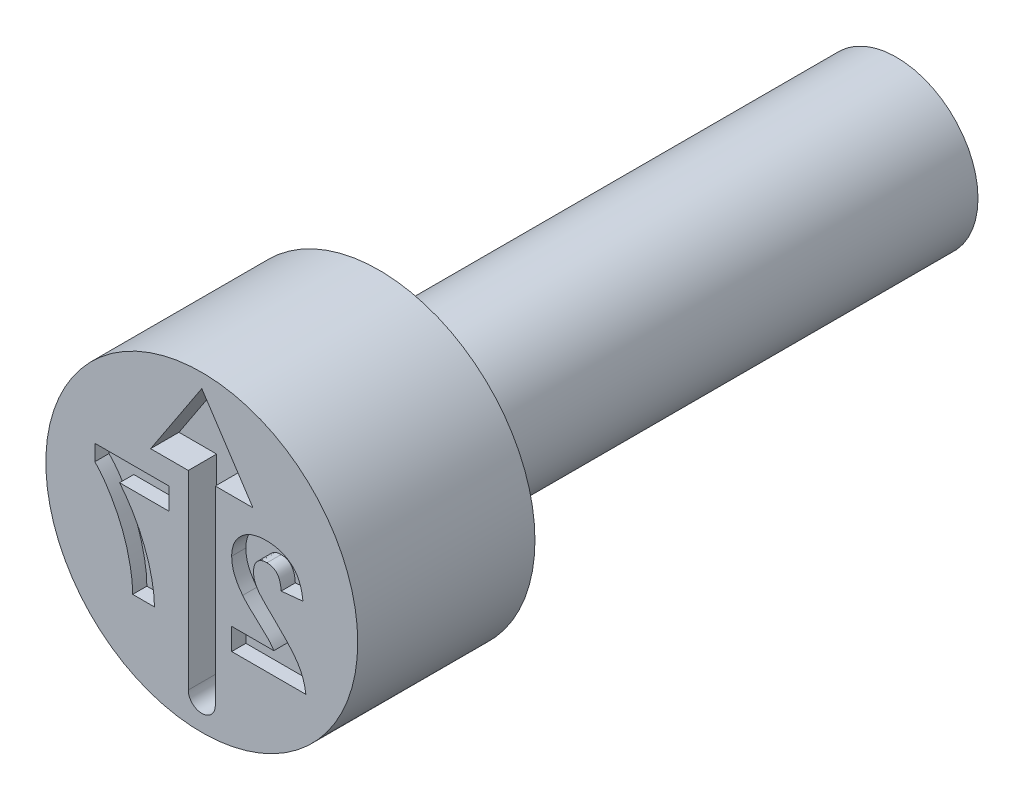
from build123d import *

# Parameters (mm, degrees)
CUT_EXTRUDE4_DEPTH = 0.4
CUT_EXTRUDE5_DEPTH = 0.2


with BuildPart() as part:
    # Sketch2 → Revolve1 (revolve)
    with BuildSketch(Plane(origin=(0, 0, 0), x_dir=(0, 0, -1), z_dir=(1, 0, 0)), mode=Mode.PRIVATE) as revolve1_sk:
        Polygon((0, 2.2), (0, 0), (9.8, 0), (9.8, 1.15), (2.5, 1.15), (2.5, 2.2), align=None)
    revolve(revolve1_sk.sketch.rotate(Axis((0, 0, -0.403888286), (0, 0, -1)), 90), axis=Axis((0, 0, -0.403888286), (0, 0, -1)))

    # Sketch3 → Cut-Extrude4 (cut)
    with BuildSketch(Plane.XY):
        with BuildLine():
            Line((0.190473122, 0.906351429), (0.190473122, -1.776161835))
            ThreePointArc((0.190473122, -1.776161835), (0, -1.966634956), (-0.190473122, -1.776161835))
            Line((-0.190473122, -1.776161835), (-0.190473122, 0.906351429))
            Line((-0.190473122, 0.906351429), (-0.721917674, 0.906351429))
            Line((-0.721917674, 0.906351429), (0, 2.002115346))
            Line((0, 2.002115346), (0.721917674, 0.906351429))
            Line((0.721917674, 0.906351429), (0.190473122, 0.906351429))
        make_face()
    extrude(amount=-CUT_EXTRUDE4_DEPTH, mode=Mode.SUBTRACT)

    # Sketch4 → Cut-Extrude5 (cut)
    with BuildSketch(Plane.XY):
        with BuildLine():
            Line((0.421794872, -0.692307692), (0.421794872, -1))
            Line((0.421794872, -1), (1.467948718, -1))
            add(Edge.make_bspline(
                [(1.467948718, -1), (1.464406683, -0.973703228), (1.4573246, -0.921124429), (1.435429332, -0.844320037), (1.406206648, -0.769372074), (1.374490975, -0.708382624), (1.342946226, -0.659288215), (1.314325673, -0.619059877), (1.280182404, -0.576258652), (1.241011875, -0.530539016), (1.197030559, -0.481758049), (1.147910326, -0.43009711), (1.093416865, -0.375803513), (1.055079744, -0.338935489), (1.03525641, -0.319871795)],
                knots=[0, 0, 0, 0, 1.156289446, 2.311930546, 3.473459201, 4.661751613, 5.303057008, 6.018253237, 6.81459331, 7.690699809, 8.644447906, 9.679642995, 10.800191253, 12, 12, 12, 12], degree=3))
            add(Edge.make_bspline(
                [(1.03525641, -0.319871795), (1.019437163, -0.30460189), (0.989321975, -0.275532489), (0.946437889, -0.233906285), (0.908738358, -0.195639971), (0.875435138, -0.161725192), (0.84729758, -0.131298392), (0.82395556, -0.104837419), (0.805113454, -0.082234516), (0.794908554, -0.06789522), (0.790384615, -0.061538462)],
                knots=[0, 0, 0, 0, 1.480720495, 2.818855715, 4.024636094, 5.098235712, 6.019786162, 6.815086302, 7.474715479, 8, 8, 8, 8], degree=3))
            add(Edge.make_bspline(
                [(0.790384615, -0.061538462), (0.781120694, -0.046150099), (0.763251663, -0.016467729), (0.743656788, 0.030208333), (0.731895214, 0.076874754), (0.730281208, 0.10805699), (0.729487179, 0.123397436)],
                knots=[0, 0, 0, 0, 1.0911822, 2.104764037, 3.067617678, 4, 4, 4, 4], degree=3))
            add(Edge.make_bspline(
                [(0.729487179, 0.123397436), (0.730063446, 0.139361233), (0.731153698, 0.169563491), (0.740295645, 0.212184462), (0.756507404, 0.248823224), (0.778828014, 0.279592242), (0.80705247, 0.303699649), (0.84004768, 0.321512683), (0.87829664, 0.331360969), (0.905180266, 0.332656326), (0.919230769, 0.333333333)],
                knots=[0, 0, 0, 0, 1.193122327, 2.257294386, 3.237245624, 4.168877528, 5.075331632, 5.990371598, 6.949684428, 8, 8, 8, 8], degree=3))
            add(Edge.make_bspline(
                [(0.919230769, 0.333333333), (0.933186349, 0.332701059), (0.960145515, 0.331479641), (0.99846034, 0.320809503), (1.03197874, 0.302338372), (1.055865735, 0.281288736), (1.072002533, 0.260819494), (1.082997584, 0.242981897), (1.09247446, 0.222712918), (1.100871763, 0.20024075), (1.107504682, 0.175307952), (1.112846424, 0.148104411), (1.117151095, 0.118483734), (1.118520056, 0.097877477), (1.119230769, 0.087179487)],
                knots=[0, 0, 0, 0, 1.402788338, 2.709884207, 3.961032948, 5.225417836, 5.883680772, 6.578928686, 7.329201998, 8.132101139, 8.990263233, 9.922304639, 10.921339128, 12, 12, 12, 12], degree=3))
            Line((1.119230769, 0.087179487), (1.426923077, 0.117307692))
            add(Edge.make_bspline(
                [(1.426923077, 0.117307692), (1.424449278, 0.138080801), (1.419652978, 0.178356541), (1.407683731, 0.236206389), (1.392525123, 0.289575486), (1.373454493, 0.338364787), (1.351260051, 0.382884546), (1.324809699, 0.422466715), (1.295027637, 0.457549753), (1.26188813, 0.488114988), (1.225601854, 0.514259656), (1.187525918, 0.537597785), (1.146916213, 0.556742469), (1.104219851, 0.572520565), (1.05945613, 0.585130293), (1.012418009, 0.593467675), (0.963395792, 0.599332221), (0.929933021, 0.599774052), (0.912820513, 0.6)],
                knots=[0, 0, 0, 0, 1.270971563, 2.464210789, 3.586263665, 4.638946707, 5.643716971, 6.603612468, 7.52484387, 8.434700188, 9.336036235, 10.239171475, 11.145359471, 12.059630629, 13.003312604, 13.96741569, 14.960557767, 16, 16, 16, 16], degree=3))
            add(Edge.make_bspline(
                [(0.912820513, 0.6), (0.894217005, 0.59964245), (0.857984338, 0.598946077), (0.805091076, 0.593195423), (0.755401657, 0.583168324), (0.708481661, 0.569886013), (0.664812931, 0.552153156), (0.624031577, 0.53071487), (0.586779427, 0.504757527), (0.552501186, 0.475696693), (0.521859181, 0.443739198), (0.495019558, 0.409651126), (0.472533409, 0.373456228), (0.453664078, 0.335595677), (0.439653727, 0.295460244), (0.429445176, 0.253604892), (0.422676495, 0.209834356), (0.422091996, 0.179940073), (0.421794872, 0.16474359)],
                knots=[0, 0, 0, 0, 1.210756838, 2.35810096, 3.457354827, 4.507168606, 5.527358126, 6.519769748, 7.499700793, 8.476517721, 9.440526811, 10.376769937, 11.295256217, 12.209626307, 13.124630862, 14.055668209, 15.011616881, 16, 16, 16, 16], degree=3))
            add(Edge.make_bspline(
                [(0.421794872, 0.16474359), (0.422186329, 0.147302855), (0.422962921, 0.112703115), (0.430398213, 0.061554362), (0.441757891, 0.011585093), (0.4585466, -0.037326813), (0.479827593, -0.086354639), (0.507259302, -0.135608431), (0.539109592, -0.186573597), (0.564047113, -0.219524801), (0.576923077, -0.236538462)],
                knots=[0, 0, 0, 0, 0.953409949, 1.89141903, 2.821310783, 3.752688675, 4.715703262, 5.740811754, 6.833515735, 8, 8, 8, 8], degree=3))
            add(Edge.make_bspline(
                [(0.576923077, -0.236538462), (0.581789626, -0.242667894), (0.592212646, -0.255795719), (0.609944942, -0.275925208), (0.630495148, -0.297912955), (0.653573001, -0.322170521), (0.679940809, -0.347838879), (0.708649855, -0.375991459), (0.740963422, -0.405188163), (0.774432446, -0.436157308), (0.80804695, -0.466299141), (0.838943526, -0.4949272), (0.867007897, -0.520256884), (0.890933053, -0.543686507), (0.912126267, -0.563617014), (0.929823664, -0.581070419), (0.944356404, -0.595624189), (0.964381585, -0.618309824), (0.989861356, -0.648992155), (1.007787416, -0.67830999), (1.016346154, -0.692307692)],
                knots=[0, 0, 0, 0, 0.665555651, 1.425465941, 2.280616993, 3.225313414, 4.272635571, 5.410053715, 6.644756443, 7.976022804, 9.288331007, 10.484517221, 11.558462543, 12.503158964, 13.33222979, 14.032602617, 14.617328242, 15.080653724, 16.606167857, 18, 18, 18, 18], degree=3))
            Line((1.016346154, -0.692307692), (0.421794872, -0.692307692))
        make_face()
        with BuildLine():
            Line((-0.461897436, 0.271794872), (-0.461897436, 0.579487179))
            Line((-0.461897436, 0.579487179), (-1.508051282, 0.579487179))
            Line((-1.508051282, 0.579487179), (-1.508051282, 0.353846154))
            add(Edge.make_bspline(
                [(-1.508051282, 0.353846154), (-1.497137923, 0.342742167), (-1.474703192, 0.31991556), (-1.442567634, 0.282557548), (-1.409955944, 0.24201755), (-1.377550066, 0.19774929), (-1.344342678, 0.150452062), (-1.311793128, 0.099219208), (-1.278780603, 0.044715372), (-1.234335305, -0.032380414), (-1.182384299, -0.13309133), (-1.127422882, -0.258280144), (-1.080598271, -0.387313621), (-1.048534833, -0.497259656), (-1.02687082, -0.585381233), (-1.012716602, -0.64981782), (-1.000801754, -0.712441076), (-0.991109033, -0.773361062), (-0.983875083, -0.83260557), (-0.978159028, -0.889968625), (-0.975338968, -0.945590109), (-0.974922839, -0.982048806), (-0.974717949, -1)],
                knots=[0, 0, 0, 0, 0.628545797, 1.29210959, 1.98878689, 2.729126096, 3.507039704, 4.322017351, 5.179550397, 6.080149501, 7.915136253, 9.752312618, 11.597470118, 13.454141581, 14.373891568, 15.261584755, 16.117868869, 16.947726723, 17.752002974, 18.527724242, 19.275094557, 20, 20, 20, 20], degree=3))
            Line((-0.974717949, -1), (-0.667025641, -1))
            add(Edge.make_bspline(
                [(-0.667025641, -1), (-0.668054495, -0.972742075), (-0.670123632, -0.917923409), (-0.677865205, -0.835642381), (-0.690024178, -0.753054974), (-0.705126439, -0.669970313), (-0.725065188, -0.586590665), (-0.74782141, -0.502607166), (-0.77538715, -0.418468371), (-0.806287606, -0.334335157), (-0.840400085, -0.251006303), (-0.877577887, -0.169515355), (-0.917724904, -0.090370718), (-0.960319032, -0.013294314), (-1.005855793, 0.061465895), (-1.05436947, 0.133828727), (-1.10517191, 0.204317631), (-1.141496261, 0.249306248), (-1.159653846, 0.271794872)],
                knots=[0, 0, 0, 0, 0.943249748, 1.896978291, 2.856365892, 3.829648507, 4.816416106, 5.820376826, 6.838120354, 7.877341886, 8.919613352, 9.951365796, 10.974227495, 11.988073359, 12.996274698, 14.000568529, 15.000536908, 16, 16, 16, 16], degree=3))
            Line((-1.159653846, 0.271794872), (-0.461897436, 0.271794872))
        make_face()
    extrude(amount=-CUT_EXTRUDE5_DEPTH, mode=Mode.SUBTRACT)


solid = part.part
